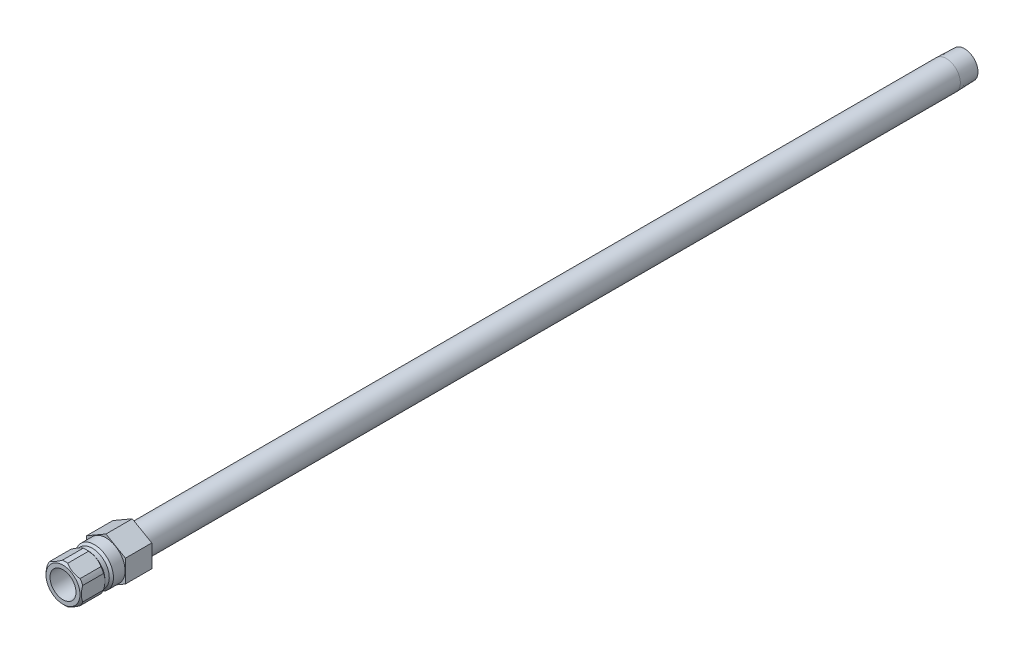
from build123d import *

# Parameters (mm, degrees)
SKETCH2_R           = 4.7625
BOSS_EXTRUDE1_DEPTH = 9.652
CUT_EXTRUDE1_START  = 6.604
SKETCH3_OUTSIDE_W   = 82.406
SKETCH3_OUTSIDE_H   = 84.606
CUT_EXTRUDE1_DEPTH  = 309.035605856


with BuildPart() as part:
    # Sketch1 → Revolve1 (revolve)
    with BuildSketch(Plane(origin=(0, 0, 0), x_dir=(0, 0, -1), z_dir=(1, 0, 0))):
        Polygon((-15.748, 4.7625), (-15.748, 6.223), (-14.986, 6.985), (-7.366, 6.985), (-6.604, 6.223), (-5.0165, 6.223), (-4.2545, 6.985), (9.652, 6.985), (9.652, 5.1435), (307.7718, 5.1435), (314.452, 4.934744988), (314.452, 3.4163), (-2.840212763, 3.4163), (-3.556, 4.7625), align=None)
    revolve(axis=Axis((0, 0, -9.652), (0, 0, 1)))

    # Sketch2 → Boss-Extrude1 (add)
    with BuildSketch(Plane.XY):
        Polygon((-7.112, 4.106115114), (-7.112, -4.106115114), (0, -8.212230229), (7.112, -4.106115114), (7.112, 4.106115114), (0, 8.212230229), align=None)
        with Locations(Location((0, 0, 0), (0, 0, 90))):
            Circle(SKETCH2_R, mode=Mode.SUBTRACT)
    extrude(amount=-BOSS_EXTRUDE1_DEPTH)

    # Sketch3 outside → Cut-Extrude1 (cut, through all)
    with BuildSketch(Plane.XY.offset(CUT_EXTRUDE1_START)):
        Rectangle(SKETCH3_OUTSIDE_W, SKETCH3_OUTSIDE_H)
        Polygon((6.477, 3.739497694), (0, 7.478995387), (-6.477, 3.739497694), (-6.477, -3.739497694), (0, -7.478995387), (6.477, -3.739497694), align=None, mode=Mode.SUBTRACT)
    extrude(amount=CUT_EXTRUDE1_DEPTH, mode=Mode.SUBTRACT)


solid = part.part
